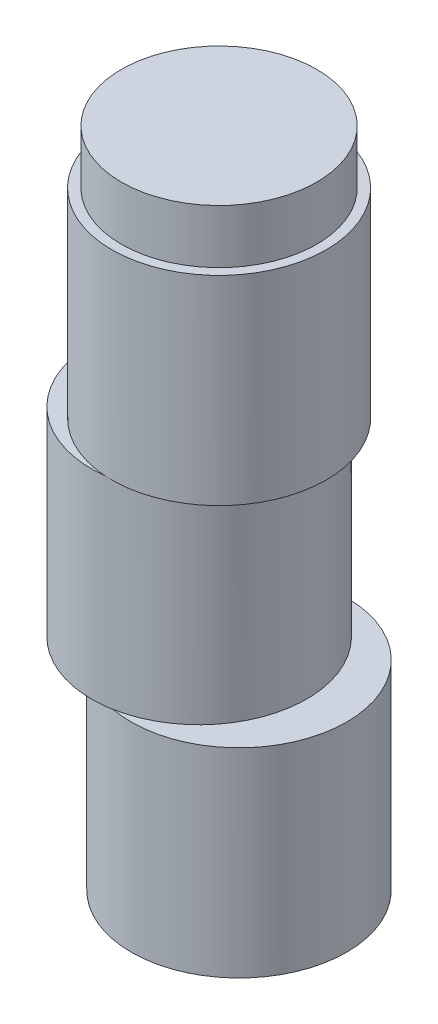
ISO-10303-21;
HEADER;
FILE_DESCRIPTION(('STEP AP214'),'2;1');
FILE_NAME('part.step','',(''),(''),'','','');
FILE_SCHEMA(('AUTOMOTIVE_DESIGN { 1 0 10303 214 1 1 1 1 }'));
ENDSEC;
DATA;
#1=APPLICATION_CONTEXT('core data for automotive mechanical design processes');
#2=APPLICATION_PROTOCOL_DEFINITION('international standard','automotive_design',2000,#1);
#3=PRODUCT_CONTEXT('',#1,'mechanical');
#4=PRODUCT('Part','Part','',(#3));
#5=PRODUCT_RELATED_PRODUCT_CATEGORY('part','',(#4));
#6=PRODUCT_DEFINITION_FORMATION('','',#4);
#7=PRODUCT_DEFINITION_CONTEXT('part definition',#1,'design');
#8=PRODUCT_DEFINITION('design','',#6,#7);
#9=PRODUCT_DEFINITION_SHAPE('','',#8);
#10=(LENGTH_UNIT() NAMED_UNIT(*) SI_UNIT(.MILLI.,.METRE.));
#11=(NAMED_UNIT(*) PLANE_ANGLE_UNIT() SI_UNIT($,.RADIAN.));
#12=(NAMED_UNIT(*) SI_UNIT($,.STERADIAN.) SOLID_ANGLE_UNIT());
#13=UNCERTAINTY_MEASURE_WITH_UNIT(LENGTH_MEASURE(1.E-05),#10,'distance_accuracy_value','');
#14=(GEOMETRIC_REPRESENTATION_CONTEXT(3) GLOBAL_UNCERTAINTY_ASSIGNED_CONTEXT((#13)) GLOBAL_UNIT_ASSIGNED_CONTEXT((#10,
#11,#12)) REPRESENTATION_CONTEXT('',''));
#15=CARTESIAN_POINT('',(0.,0.,0.));
#16=DIRECTION('',(0.,0.,1.));
#17=DIRECTION('',(1.,0.,0.));
#18=AXIS2_PLACEMENT_3D('',#15,#16,#17);
#19=CARTESIAN_POINT('',(0.,10.,0.));
#20=DIRECTION('',(0.,-1.,0.));
#21=DIRECTION('',(0.,0.,-1.));
#22=AXIS2_PLACEMENT_3D('',#19,#20,#21);
#23=CYLINDRICAL_SURFACE('',#22,5.375);
#24=CARTESIAN_POINT('',(0.,10.,0.));
#25=DIRECTION('',(0.,1.,0.));
#26=DIRECTION('',(0.,0.,1.));
#27=AXIS2_PLACEMENT_3D('',#24,#25,#26);
#28=CIRCLE('',#27,5.375);
#29=CARTESIAN_POINT('',(0.,10.,5.375));
#30=VERTEX_POINT('',#29);
#31=EDGE_CURVE('E52',#30,#30,#28,.T.);
#32=ORIENTED_EDGE('',*,*,#31,.F.);
#33=EDGE_LOOP('',(#32));
#34=FACE_BOUND('',#33,.T.);
#35=CARTESIAN_POINT('',(0.,0.,0.));
#36=DIRECTION('',(0.,1.,0.));
#37=DIRECTION('',(0.,0.,1.));
#38=AXIS2_PLACEMENT_3D('',#35,#36,#37);
#39=CIRCLE('',#38,5.375);
#40=CARTESIAN_POINT('',(-0.365312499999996,0.,-5.36257137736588));
#41=VERTEX_POINT('',#40);
#42=CARTESIAN_POINT('',(-0.365312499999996,0.,5.36257137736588));
#43=VERTEX_POINT('',#42);
#44=EDGE_CURVE('E46',#41,#43,#39,.T.);
#45=ORIENTED_EDGE('',*,*,#44,.T.);
#46=EDGE_CURVE('E83',#43,#41,#39,.T.);
#47=ORIENTED_EDGE('',*,*,#46,.T.);
#48=EDGE_LOOP('',(#45,#47));
#49=FACE_BOUND('',#48,.T.);
#50=ADVANCED_FACE('F43',(#34,#49),#23,.T.);
#51=CARTESIAN_POINT('',(0.,10.,0.));
#52=DIRECTION('',(0.,1.,0.));
#53=DIRECTION('',(0.,0.,1.));
#54=AXIS2_PLACEMENT_3D('',#51,#52,#53);
#55=PLANE('',#54);
#56=CARTESIAN_POINT('',(0.,10.,0.));
#57=DIRECTION('',(0.,1.,0.));
#58=DIRECTION('',(0.,0.,1.));
#59=AXIS2_PLACEMENT_3D('',#56,#57,#58);
#60=CIRCLE('',#59,4.9);
#61=CARTESIAN_POINT('',(0.,10.,-4.9));
#62=VERTEX_POINT('',#61);
#63=EDGE_CURVE('E11',#62,#62,#60,.T.);
#64=ORIENTED_EDGE('',*,*,#63,.F.);
#65=EDGE_LOOP('',(#64));
#66=FACE_BOUND('',#65,.T.);
#67=ORIENTED_EDGE('',*,*,#31,.T.);
#68=EDGE_LOOP('',(#67));
#69=FACE_BOUND('',#68,.T.);
#70=ADVANCED_FACE('F123',(#66,#69),#55,.T.);
#71=CARTESIAN_POINT('',(0.,0.,0.));
#72=DIRECTION('',(0.,1.,0.));
#73=DIRECTION('',(0.,0.,1.));
#74=AXIS2_PLACEMENT_3D('',#71,#72,#73);
#75=PLANE('',#74);
#76=CARTESIAN_POINT('',(-1.,0.,0.));
#77=DIRECTION('',(0.,-1.,0.));
#78=DIRECTION('',(0.,0.,-1.));
#79=AXIS2_PLACEMENT_3D('',#76,#77,#78);
#80=CIRCLE('',#79,5.4);
#81=EDGE_CURVE('E66',#41,#43,#80,.T.);
#82=ORIENTED_EDGE('',*,*,#81,.F.);
#83=ORIENTED_EDGE('',*,*,#46,.F.);
#84=EDGE_LOOP('',(#82,#83));
#85=FACE_BOUND('',#84,.T.);
#86=ADVANCED_FACE('F116',(#85),#75,.F.);
#87=CARTESIAN_POINT('',(-1.,-10.,0.));
#88=DIRECTION('',(0.,1.,0.));
#89=DIRECTION('',(0.,0.,1.));
#90=AXIS2_PLACEMENT_3D('',#87,#88,#89);
#91=CYLINDRICAL_SURFACE('',#90,5.4);
#92=CARTESIAN_POINT('',(-1.,-10.,0.));
#93=DIRECTION('',(0.,-1.,0.));
#94=DIRECTION('',(0.,0.,-1.));
#95=AXIS2_PLACEMENT_3D('',#92,#93,#94);
#96=CIRCLE('',#95,5.4);
#97=CARTESIAN_POINT('',(0.,-10.,-5.30659966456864));
#98=VERTEX_POINT('',#97);
#99=CARTESIAN_POINT('',(0.,-10.,5.30659966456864));
#100=VERTEX_POINT('',#99);
#101=EDGE_CURVE('E75',#98,#100,#96,.T.);
#102=ORIENTED_EDGE('',*,*,#101,.F.);
#103=EDGE_CURVE('E78',#100,#98,#96,.T.);
#104=ORIENTED_EDGE('',*,*,#103,.F.);
#105=EDGE_LOOP('',(#102,#104));
#106=FACE_BOUND('',#105,.T.);
#107=ORIENTED_EDGE('',*,*,#81,.T.);
#108=EDGE_CURVE('E98',#43,#41,#80,.T.);
#109=ORIENTED_EDGE('',*,*,#108,.T.);
#110=EDGE_LOOP('',(#107,#109));
#111=FACE_BOUND('',#110,.T.);
#112=ADVANCED_FACE('F76',(#106,#111),#91,.T.);
#113=CARTESIAN_POINT('',(-1.,-10.,0.));
#114=DIRECTION('',(0.,-1.,0.));
#115=DIRECTION('',(0.,0.,-1.));
#116=AXIS2_PLACEMENT_3D('',#113,#114,#115);
#117=PLANE('',#116);
#118=CARTESIAN_POINT('',(1.,-10.,0.));
#119=DIRECTION('',(0.,-1.,0.));
#120=DIRECTION('',(0.,0.,-1.));
#121=AXIS2_PLACEMENT_3D('',#118,#119,#120);
#122=CIRCLE('',#121,5.4);
#123=EDGE_CURVE('E59',#100,#98,#122,.T.);
#124=ORIENTED_EDGE('',*,*,#123,.F.);
#125=ORIENTED_EDGE('',*,*,#103,.T.);
#126=EDGE_LOOP('',(#124,#125));
#127=FACE_BOUND('',#126,.T.);
#128=ADVANCED_FACE('F85',(#127),#117,.T.);
#129=CARTESIAN_POINT('',(-1.,0.,0.));
#130=DIRECTION('',(0.,-1.,0.));
#131=DIRECTION('',(0.,0.,-1.));
#132=AXIS2_PLACEMENT_3D('',#129,#130,#131);
#133=PLANE('',#132);
#134=ORIENTED_EDGE('',*,*,#44,.F.);
#135=ORIENTED_EDGE('',*,*,#108,.F.);
#136=EDGE_LOOP('',(#134,#135));
#137=FACE_BOUND('',#136,.T.);
#138=ADVANCED_FACE('F113',(#137),#133,.F.);
#139=CARTESIAN_POINT('',(1.,-10.,0.));
#140=DIRECTION('',(0.,-1.,0.));
#141=DIRECTION('',(0.,0.,-1.));
#142=AXIS2_PLACEMENT_3D('',#139,#140,#141);
#143=PLANE('',#142);
#144=EDGE_CURVE('E87',#98,#100,#122,.T.);
#145=ORIENTED_EDGE('',*,*,#144,.F.);
#146=ORIENTED_EDGE('',*,*,#101,.T.);
#147=EDGE_LOOP('',(#145,#146));
#148=FACE_BOUND('',#147,.T.);
#149=ADVANCED_FACE('F88',(#148),#143,.F.);
#150=CARTESIAN_POINT('',(1.,-20.,0.));
#151=DIRECTION('',(0.,1.,0.));
#152=DIRECTION('',(0.,0.,1.));
#153=AXIS2_PLACEMENT_3D('',#150,#151,#152);
#154=CYLINDRICAL_SURFACE('',#153,5.4);
#155=CARTESIAN_POINT('',(1.,-20.,0.));
#156=DIRECTION('',(0.,-1.,0.));
#157=DIRECTION('',(0.,0.,-1.));
#158=AXIS2_PLACEMENT_3D('',#155,#156,#157);
#159=CIRCLE('',#158,5.4);
#160=CARTESIAN_POINT('',(1.,-20.,-5.4));
#161=VERTEX_POINT('',#160);
#162=EDGE_CURVE('E95',#161,#161,#159,.T.);
#163=ORIENTED_EDGE('',*,*,#162,.F.);
#164=EDGE_LOOP('',(#163));
#165=FACE_BOUND('',#164,.T.);
#166=ORIENTED_EDGE('',*,*,#123,.T.);
#167=ORIENTED_EDGE('',*,*,#144,.T.);
#168=EDGE_LOOP('',(#166,#167));
#169=FACE_BOUND('',#168,.T.);
#170=ADVANCED_FACE('F93',(#165,#169),#154,.T.);
#171=CARTESIAN_POINT('',(1.,-20.,0.));
#172=DIRECTION('',(0.,-1.,0.));
#173=DIRECTION('',(0.,0.,-1.));
#174=AXIS2_PLACEMENT_3D('',#171,#172,#173);
#175=PLANE('',#174);
#176=ORIENTED_EDGE('',*,*,#162,.T.);
#177=EDGE_LOOP('',(#176));
#178=FACE_BOUND('',#177,.T.);
#179=ADVANCED_FACE('F139',(#178),#175,.T.);
#180=CARTESIAN_POINT('',(0.,12.7,0.));
#181=DIRECTION('',(0.,-1.,0.));
#182=DIRECTION('',(0.,0.,-1.));
#183=AXIS2_PLACEMENT_3D('',#180,#181,#182);
#184=CYLINDRICAL_SURFACE('',#183,4.9);
#185=CARTESIAN_POINT('',(0.,12.7,0.));
#186=DIRECTION('',(0.,1.,0.));
#187=DIRECTION('',(0.,0.,1.));
#188=AXIS2_PLACEMENT_3D('',#185,#186,#187);
#189=CIRCLE('',#188,4.9);
#190=CARTESIAN_POINT('',(0.,12.7,-4.9));
#191=VERTEX_POINT('',#190);
#192=EDGE_CURVE('E91',#191,#191,#189,.T.);
#193=CARTESIAN_POINT('',(0.,12.7,-4.9));
#194=CARTESIAN_POINT('',(0.,12.671875,-4.9));
#195=CARTESIAN_POINT('',(0.,12.64375,-4.9));
#196=CARTESIAN_POINT('',(0.,12.5875,-4.9));
#197=CARTESIAN_POINT('',(0.,12.559375,-4.9));
#198=CARTESIAN_POINT('',(0.,12.503125,-4.9));
#199=CARTESIAN_POINT('',(0.,12.475,-4.9));
#200=CARTESIAN_POINT('',(0.,12.41875,-4.9));
#201=CARTESIAN_POINT('',(0.,12.390625,-4.9));
#202=CARTESIAN_POINT('',(0.,12.334375,-4.9));
#203=CARTESIAN_POINT('',(0.,12.30625,-4.9));
#204=CARTESIAN_POINT('',(0.,12.25,-4.9));
#205=CARTESIAN_POINT('',(0.,12.221875,-4.9));
#206=CARTESIAN_POINT('',(0.,12.165625,-4.9));
#207=CARTESIAN_POINT('',(0.,12.1375,-4.9));
#208=CARTESIAN_POINT('',(0.,12.08125,-4.9));
#209=CARTESIAN_POINT('',(0.,12.053125,-4.9));
#210=CARTESIAN_POINT('',(0.,11.996875,-4.9));
#211=CARTESIAN_POINT('',(0.,11.96875,-4.9));
#212=CARTESIAN_POINT('',(0.,11.9125,-4.9));
#213=CARTESIAN_POINT('',(0.,11.884375,-4.9));
#214=CARTESIAN_POINT('',(0.,11.828125,-4.9));
#215=CARTESIAN_POINT('',(0.,11.8,-4.9));
#216=CARTESIAN_POINT('',(0.,11.74375,-4.9));
#217=CARTESIAN_POINT('',(0.,11.715625,-4.9));
#218=CARTESIAN_POINT('',(0.,11.659375,-4.9));
#219=CARTESIAN_POINT('',(0.,11.63125,-4.9));
#220=CARTESIAN_POINT('',(0.,11.575,-4.9));
#221=CARTESIAN_POINT('',(0.,11.546875,-4.9));
#222=CARTESIAN_POINT('',(0.,11.490625,-4.9));
#223=CARTESIAN_POINT('',(0.,11.4625,-4.9));
#224=CARTESIAN_POINT('',(0.,11.40625,-4.9));
#225=CARTESIAN_POINT('',(0.,11.378125,-4.9));
#226=CARTESIAN_POINT('',(0.,11.321875,-4.9));
#227=CARTESIAN_POINT('',(0.,11.29375,-4.9));
#228=CARTESIAN_POINT('',(0.,11.2375,-4.9));
#229=CARTESIAN_POINT('',(0.,11.209375,-4.9));
#230=CARTESIAN_POINT('',(0.,11.153125,-4.9));
#231=CARTESIAN_POINT('',(0.,11.125,-4.9));
#232=CARTESIAN_POINT('',(0.,11.06875,-4.9));
#233=CARTESIAN_POINT('',(0.,11.040625,-4.9));
#234=CARTESIAN_POINT('',(0.,10.984375,-4.9));
#235=CARTESIAN_POINT('',(0.,10.95625,-4.9));
#236=CARTESIAN_POINT('',(0.,10.9,-4.9));
#237=CARTESIAN_POINT('',(0.,10.871875,-4.9));
#238=CARTESIAN_POINT('',(0.,10.815625,-4.9));
#239=CARTESIAN_POINT('',(0.,10.7875,-4.9));
#240=CARTESIAN_POINT('',(0.,10.73125,-4.9));
#241=CARTESIAN_POINT('',(0.,10.703125,-4.9));
#242=CARTESIAN_POINT('',(0.,10.646875,-4.9));
#243=CARTESIAN_POINT('',(0.,10.61875,-4.9));
#244=CARTESIAN_POINT('',(0.,10.5625,-4.9));
#245=CARTESIAN_POINT('',(0.,10.534375,-4.9));
#246=CARTESIAN_POINT('',(0.,10.478125,-4.9));
#247=CARTESIAN_POINT('',(0.,10.45,-4.9));
#248=CARTESIAN_POINT('',(0.,10.39375,-4.9));
#249=CARTESIAN_POINT('',(0.,10.365625,-4.9));
#250=CARTESIAN_POINT('',(0.,10.309375,-4.9));
#251=CARTESIAN_POINT('',(0.,10.28125,-4.9));
#252=CARTESIAN_POINT('',(0.,10.225,-4.9));
#253=CARTESIAN_POINT('',(0.,10.196875,-4.9));
#254=CARTESIAN_POINT('',(0.,10.140625,-4.9));
#255=CARTESIAN_POINT('',(0.,10.1125,-4.9));
#256=CARTESIAN_POINT('',(0.,10.05625,-4.9));
#257=CARTESIAN_POINT('',(0.,10.028125,-4.9));
#258=CARTESIAN_POINT('',(0.,10.,-4.9));
#259=B_SPLINE_CURVE_WITH_KNOTS('',3,(#193,#194,#195,#196,#197,#198,#199,#200,#201,#202,#203,
#204,#205,#206,#207,#208,#209,#210,#211,#212,#213,#214,#215,#216,#217,#218,#219,#220,#221,#222,
#223,#224,#225,#226,#227,#228,#229,#230,#231,#232,#233,#234,#235,#236,#237,#238,#239,#240,#241,
#242,#243,#244,#245,#246,#247,#248,#249,#250,#251,#252,#253,#254,#255,#256,#257,#258),
.UNSPECIFIED.,.F.,.F.,(4,2,2,2,2,2,2,2,2,2,2,2,2,2,2,2,2,2,2,2,2,2,2,2,2,2,2,2,2,2,2,2,4),(0.,
0.0843750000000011,0.168750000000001,0.253125,0.337500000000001,0.421875,0.50625,
0.590625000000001,0.675,0.759375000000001,0.843750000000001,0.928125,1.0125,1.096875,1.18125,
1.265625,1.35,1.434375,1.51875,1.603125,1.6875,1.771875,1.85625,1.940625,2.025,2.109375,2.19375,
2.278125,2.3625,2.446875,2.53125,2.615625,2.7),.UNSPECIFIED.);
#260=EDGE_CURVE('BSEAM136',#191,#62,#259,.T.);
#261=ORIENTED_EDGE('',*,*,#192,.F.);
#262=ORIENTED_EDGE('',*,*,#63,.T.);
#263=ORIENTED_EDGE('',*,*,#260,.T.);
#264=ORIENTED_EDGE('',*,*,#260,.F.);
#265=EDGE_LOOP('',(#261,#263,#262,#264));
#266=FACE_BOUND('',#265,.T.);
#267=ADVANCED_FACE('F136',(#266),#184,.T.);
#268=CARTESIAN_POINT('',(0.,12.7,0.));
#269=DIRECTION('',(0.,1.,0.));
#270=DIRECTION('',(0.,0.,1.));
#271=AXIS2_PLACEMENT_3D('',#268,#269,#270);
#272=PLANE('',#271);
#273=ORIENTED_EDGE('',*,*,#192,.T.);
#274=EDGE_LOOP('',(#273));
#275=FACE_BOUND('',#274,.T.);
#276=ADVANCED_FACE('F138',(#275),#272,.T.);
#277=CLOSED_SHELL('',(#50,#70,#86,#112,#128,#138,#149,#170,#179,#267,#276));
#278=MANIFOLD_SOLID_BREP('B2',#277);
#279=ADVANCED_BREP_SHAPE_REPRESENTATION('',(#18,#278),#14);
#280=SHAPE_DEFINITION_REPRESENTATION(#9,#279);
ENDSEC;
END-ISO-10303-21;
